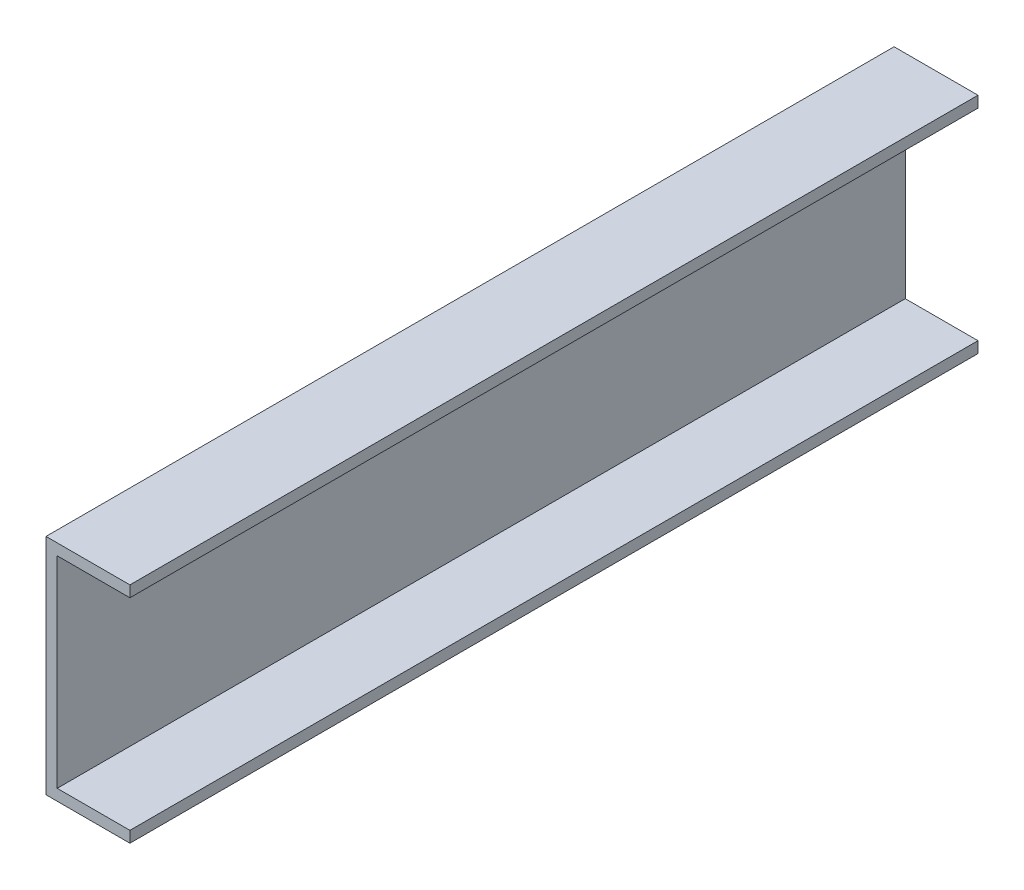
from build123d import *

# Parameters (mm, degrees)
BOSS_EXTRUDE1_DEPTH = 379


with BuildPart() as part:
    # Sketch1 → Boss-Extrude1 (new, symmetric)
    with BuildSketch(Plane.XY):
        Polygon((75, 0), (0, 0), (0, 200), (75, 200), (75, 190), (10, 190), (10, 10), (75, 10), align=None)
    extrude(amount=BOSS_EXTRUDE1_DEPTH, both=True)


solid = part.part
